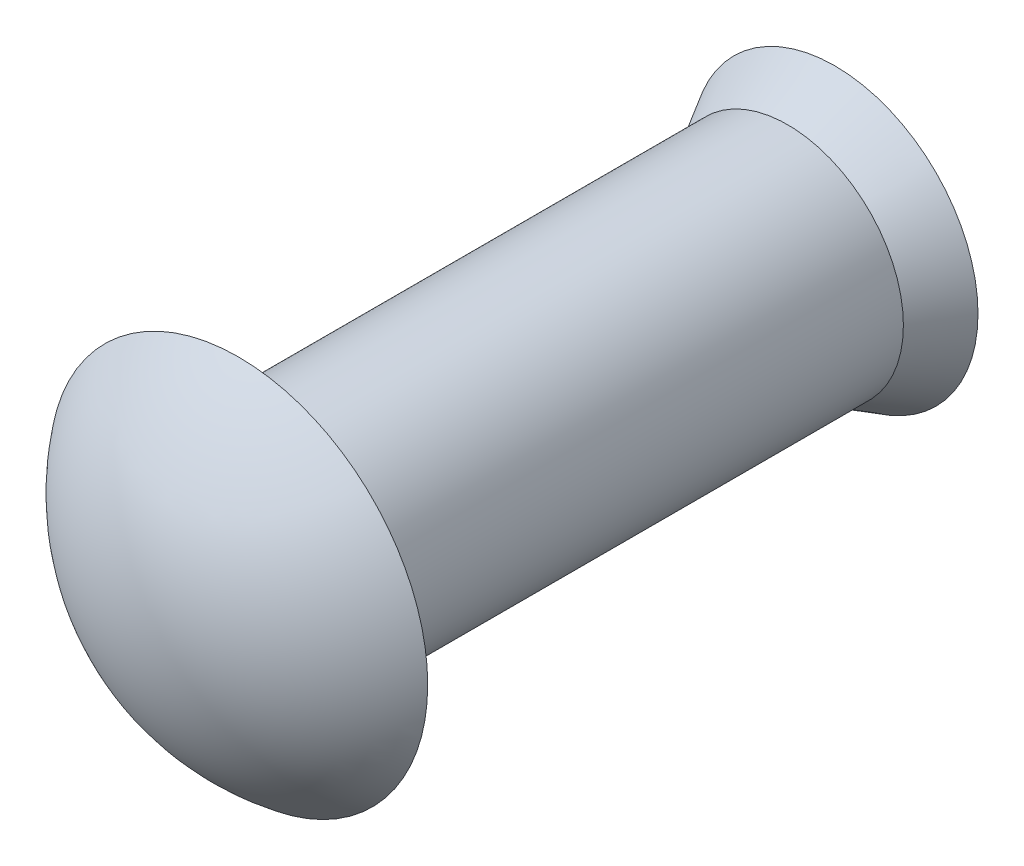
ISO-10303-21;
HEADER;
FILE_DESCRIPTION(('STEP AP214'),'2;1');
FILE_NAME('part.step','',(''),(''),'','','');
FILE_SCHEMA(('AUTOMOTIVE_DESIGN { 1 0 10303 214 1 1 1 1 }'));
ENDSEC;
DATA;
#1=APPLICATION_CONTEXT('core data for automotive mechanical design processes');
#2=APPLICATION_PROTOCOL_DEFINITION('international standard','automotive_design',2000,#1);
#3=PRODUCT_CONTEXT('',#1,'mechanical');
#4=PRODUCT('Part','Part','',(#3));
#5=PRODUCT_RELATED_PRODUCT_CATEGORY('part','',(#4));
#6=PRODUCT_DEFINITION_FORMATION('','',#4);
#7=PRODUCT_DEFINITION_CONTEXT('part definition',#1,'design');
#8=PRODUCT_DEFINITION('design','',#6,#7);
#9=PRODUCT_DEFINITION_SHAPE('','',#8);
#10=(LENGTH_UNIT() NAMED_UNIT(*) SI_UNIT(.MILLI.,.METRE.));
#11=(NAMED_UNIT(*) PLANE_ANGLE_UNIT() SI_UNIT($,.RADIAN.));
#12=(NAMED_UNIT(*) SI_UNIT($,.STERADIAN.) SOLID_ANGLE_UNIT());
#13=UNCERTAINTY_MEASURE_WITH_UNIT(LENGTH_MEASURE(1.E-05),#10,'distance_accuracy_value','');
#14=(GEOMETRIC_REPRESENTATION_CONTEXT(3) GLOBAL_UNCERTAINTY_ASSIGNED_CONTEXT((#13)) GLOBAL_UNIT_ASSIGNED_CONTEXT((#10,
#11,#12)) REPRESENTATION_CONTEXT('',''));
#15=CARTESIAN_POINT('',(0.,0.,0.));
#16=DIRECTION('',(0.,0.,1.));
#17=DIRECTION('',(1.,0.,0.));
#18=AXIS2_PLACEMENT_3D('',#15,#16,#17);
#19=CARTESIAN_POINT('',(0.,0.,-3.96875));
#20=DIRECTION('',(0.,0.,1.));
#21=DIRECTION('',(0.,1.,0.));
#22=AXIS2_PLACEMENT_3D('',#19,#20,#21);
#23=SPHERICAL_SURFACE('',#22,3.96875);
#24=CARTESIAN_POINT('',(0.,0.,-1.5875));
#25=DIRECTION('',(0.,0.,1.));
#26=DIRECTION('',(1.,0.,0.));
#27=AXIS2_PLACEMENT_3D('',#24,#25,#26);
#28=CIRCLE('',#27,3.175);
#29=CARTESIAN_POINT('',(3.175,0.,-1.5875));
#30=VERTEX_POINT('',#29);
#31=EDGE_CURVE('E10',#30,#30,#28,.T.);
#32=ORIENTED_EDGE('',*,*,#31,.T.);
#33=EDGE_LOOP('',(#32));
#34=FACE_BOUND('',#33,.T.);
#35=ADVANCED_FACE('F35',(#34),#23,.T.);
#36=CARTESIAN_POINT('',(0.,3.175,-1.5875));
#37=DIRECTION('',(0.,0.,1.));
#38=DIRECTION('',(1.,0.,0.));
#39=AXIS2_PLACEMENT_3D('',#36,#37,#38);
#40=PLANE('',#39);
#41=ORIENTED_EDGE('',*,*,#31,.F.);
#42=EDGE_LOOP('',(#41));
#43=FACE_BOUND('',#42,.T.);
#44=CARTESIAN_POINT('',(0.,0.,-1.5875));
#45=DIRECTION('',(0.,0.,1.));
#46=DIRECTION('',(1.,0.,0.));
#47=AXIS2_PLACEMENT_3D('',#44,#45,#46);
#48=CIRCLE('',#47,1.9431);
#49=CARTESIAN_POINT('',(1.9431,0.,-1.5875));
#50=VERTEX_POINT('',#49);
#51=EDGE_CURVE('E41',#50,#50,#48,.T.);
#52=ORIENTED_EDGE('',*,*,#51,.T.);
#53=EDGE_LOOP('',(#52));
#54=FACE_BOUND('',#53,.T.);
#55=ADVANCED_FACE('F67',(#43,#54),#40,.F.);
#56=CARTESIAN_POINT('',(0.,0.,0.));
#57=DIRECTION('',(0.,0.,1.));
#58=DIRECTION('',(1.,0.,0.));
#59=AXIS2_PLACEMENT_3D('',#56,#57,#58);
#60=CYLINDRICAL_SURFACE('',#59,1.9431);
#61=ORIENTED_EDGE('',*,*,#51,.F.);
#62=EDGE_LOOP('',(#61));
#63=FACE_BOUND('',#62,.T.);
#64=CARTESIAN_POINT('',(0.,0.,-10.80262));
#65=DIRECTION('',(0.,0.,1.));
#66=DIRECTION('',(1.,0.,0.));
#67=AXIS2_PLACEMENT_3D('',#64,#65,#66);
#68=CIRCLE('',#67,1.9431);
#69=CARTESIAN_POINT('',(1.9431,0.,-10.80262));
#70=VERTEX_POINT('',#69);
#71=EDGE_CURVE('E45',#70,#70,#68,.T.);
#72=ORIENTED_EDGE('',*,*,#71,.T.);
#73=EDGE_LOOP('',(#72));
#74=FACE_BOUND('',#73,.T.);
#75=ADVANCED_FACE('F63',(#63,#74),#60,.T.);
#76=CARTESIAN_POINT('',(0.,0.,-11.59637));
#77=DIRECTION('',(0.,0.,-1.));
#78=DIRECTION('',(-1.,0.,0.));
#79=AXIS2_PLACEMENT_3D('',#76,#77,#78);
#80=CONICAL_SURFACE('',#79,2.40137177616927,0.5235987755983);
#81=ORIENTED_EDGE('',*,*,#71,.F.);
#82=EDGE_LOOP('',(#81));
#83=FACE_BOUND('',#82,.T.);
#84=CARTESIAN_POINT('',(0.,0.,-11.59637));
#85=DIRECTION('',(0.,0.,1.));
#86=DIRECTION('',(1.,0.,0.));
#87=AXIS2_PLACEMENT_3D('',#84,#85,#86);
#88=CIRCLE('',#87,2.40137177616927);
#89=CARTESIAN_POINT('',(2.40137177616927,0.,-11.59637));
#90=VERTEX_POINT('',#89);
#91=EDGE_CURVE('E49',#90,#90,#88,.T.);
#92=ORIENTED_EDGE('',*,*,#91,.T.);
#93=EDGE_LOOP('',(#92));
#94=FACE_BOUND('',#93,.T.);
#95=ADVANCED_FACE('F55',(#83,#94),#80,.T.);
#96=CARTESIAN_POINT('',(0.,2.40137177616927,-11.59637));
#97=DIRECTION('',(0.,0.,1.));
#98=DIRECTION('',(1.,0.,0.));
#99=AXIS2_PLACEMENT_3D('',#96,#97,#98);
#100=PLANE('',#99);
#101=ORIENTED_EDGE('',*,*,#91,.F.);
#102=EDGE_LOOP('',(#101));
#103=FACE_BOUND('',#102,.T.);
#104=ADVANCED_FACE('F57',(#103),#100,.F.);
#105=CLOSED_SHELL('',(#35,#55,#75,#95,#104));
#106=MANIFOLD_SOLID_BREP('B2',#105);
#107=ADVANCED_BREP_SHAPE_REPRESENTATION('',(#18,#106),#14);
#108=SHAPE_DEFINITION_REPRESENTATION(#9,#107);
ENDSEC;
END-ISO-10303-21;
